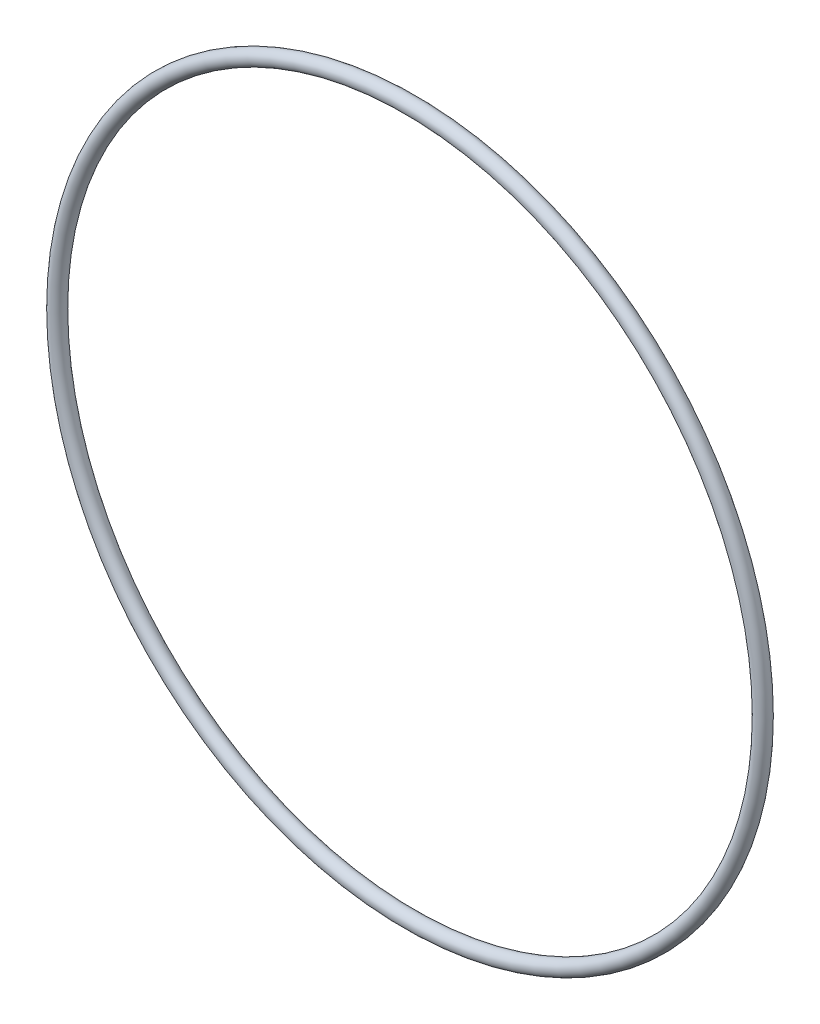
from build123d import *

# Parameters (mm, degrees)
SKETCH1_R = 0.889


with BuildPart() as part:
    # Sweep1: sweep along a path in Sketch3
    with BuildLine(Plane.XY) as sweep1_path:
        CenterArc((42.0243, 0), 42.0243, 0, 360)
    # Sketch1 → Sweep1 (sweep)
    with BuildSketch(Plane(origin=(0, 0, 0), x_dir=(1, 0, 0), z_dir=(0, 1, 0))):
        Circle(SKETCH1_R)
    sweep(path=sweep1_path.line)


solid = part.part
